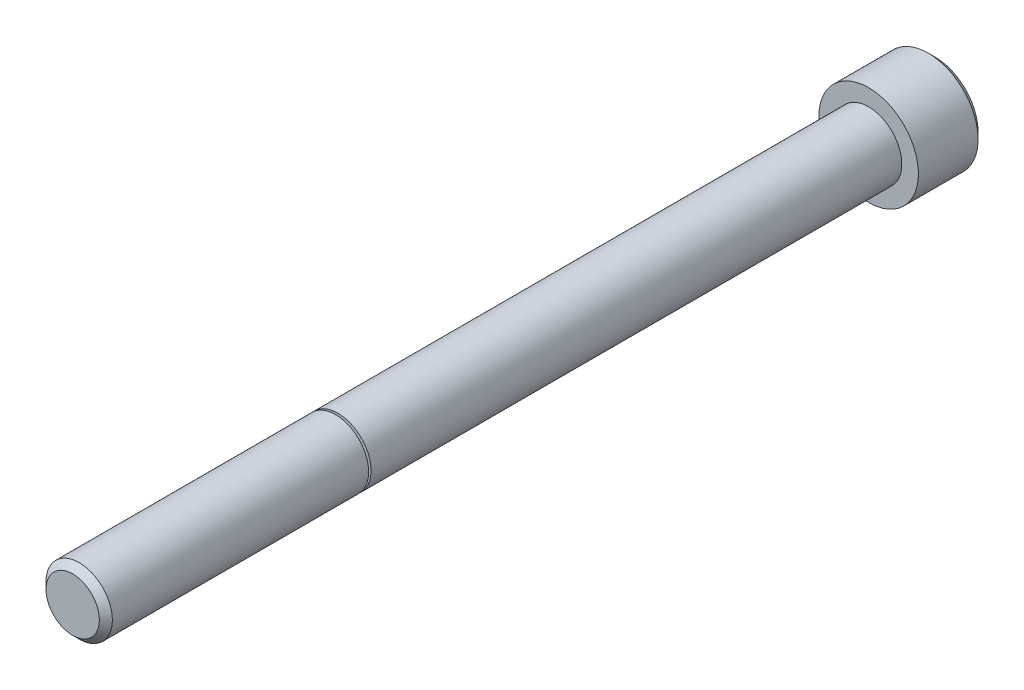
from build123d import *

# Parameters (mm, degrees)
CUT_EXTRUDE1_DEPTH = 3.175


with BuildPart() as part:
    # Logo3_bib1 → Revolve1 (revolve)
    with BuildSketch(Plane(origin=(0, 0, 0), x_dir=(-1, 0, 0), z_dir=(0, -1, 0))):
        with BuildLine():
            Line((0, -76.2), (0, 6.35))
            Line((0, 6.35), (4.1275, 6.35))
            Line((4.1275, 6.35), (4.7625, 5.715))
            Line((4.7625, 5.715), (4.7625, 0))
            Line((4.7625, 0), (3.175, 0))
            Line((3.175, 0), (3.175, -50.81))
            Line((3.175, -50.81), (2.666125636, -50.81))
            ThreePointArc((2.666125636, -50.81), (2.646429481, -50.826527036), (2.659285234, -50.848793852))
            Line((2.659285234, -50.848793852), (3.175, -51.036498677))
            Line((3.175, -51.036498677), (3.175, -75.5777))
            Line((3.175, -75.5777), (2.5527, -76.2))
            Line((2.5527, -76.2), (0, -76.2))
        make_face()
    revolve(axis=Axis((0, 0, -10.585154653), (0, 0, 1)))

    # Logo3_bib2 → Cut-Extrude1 (cut)
    with BuildSketch(Plane(origin=(0, 0, -6.35), x_dir=(1, 0, 0), z_dir=(0, 0, -1))):
        Polygon((2.749630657, 0), (1.374815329, 2.38125), (-1.374815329, 2.38125), (-2.749630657, 0), (-1.374815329, -2.38125), (1.374815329, -2.38125), align=None)
    extrude(amount=-CUT_EXTRUDE1_DEPTH, mode=Mode.SUBTRACT)


solid = part.part
